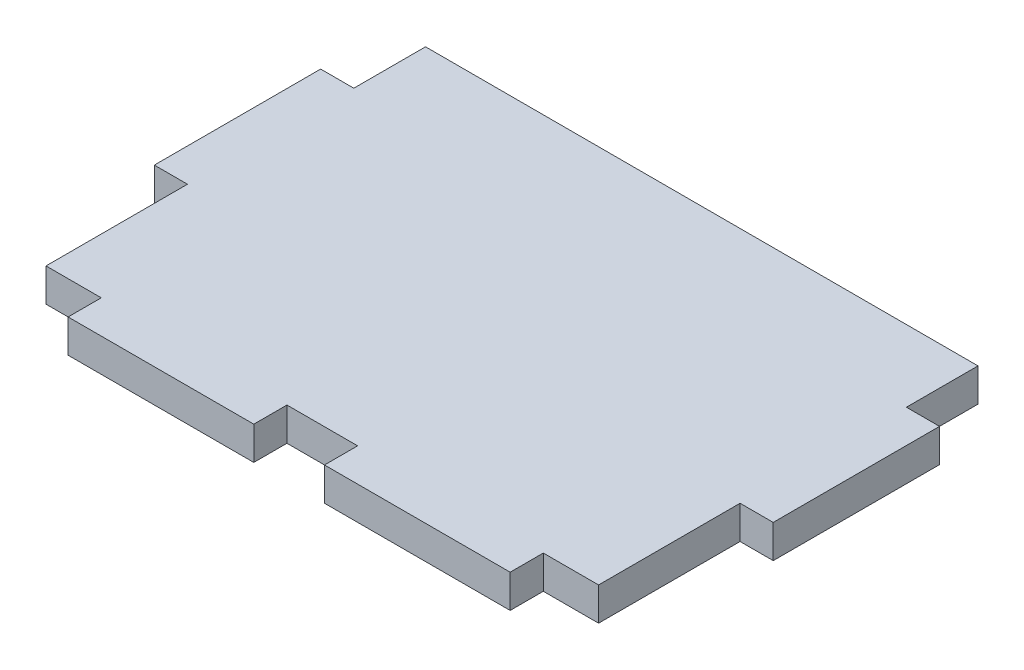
from build123d import *

# Parameters (mm, degrees)
EXTRUDE_1_DEPTH = 3


with BuildPart() as part:
    # Sketch 1 → Extrude 1 (new body)
    with BuildSketch(Plane(origin=(0, 0, 0), x_dir=(1, 0, 0), z_dir=(0, 1, 0))):
        Polygon((-874.437806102, 468.757487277), (-874.437806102, 462.277187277), (-871.437806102, 462.277187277), (-871.437806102, 447.227487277), (-874.437806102, 447.227487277), (-874.437806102, 434.424887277), (-879.437806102, 434.424887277), (-879.437806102, 431.424887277), (-896.240072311, 431.424887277), (-896.240072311, 434.424887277), (-902.635539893, 434.424887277), (-902.635539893, 431.424887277), (-919.437806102, 431.424887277), (-919.437806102, 434.424887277), (-924.437806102, 434.424887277), (-924.437806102, 447.227487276), (-927.437806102, 447.227487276), (-927.437806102, 462.277187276), (-924.437806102, 462.277187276), (-924.437806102, 468.767487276), align=None)
    extrude(amount=EXTRUDE_1_DEPTH)


solid = part.part
